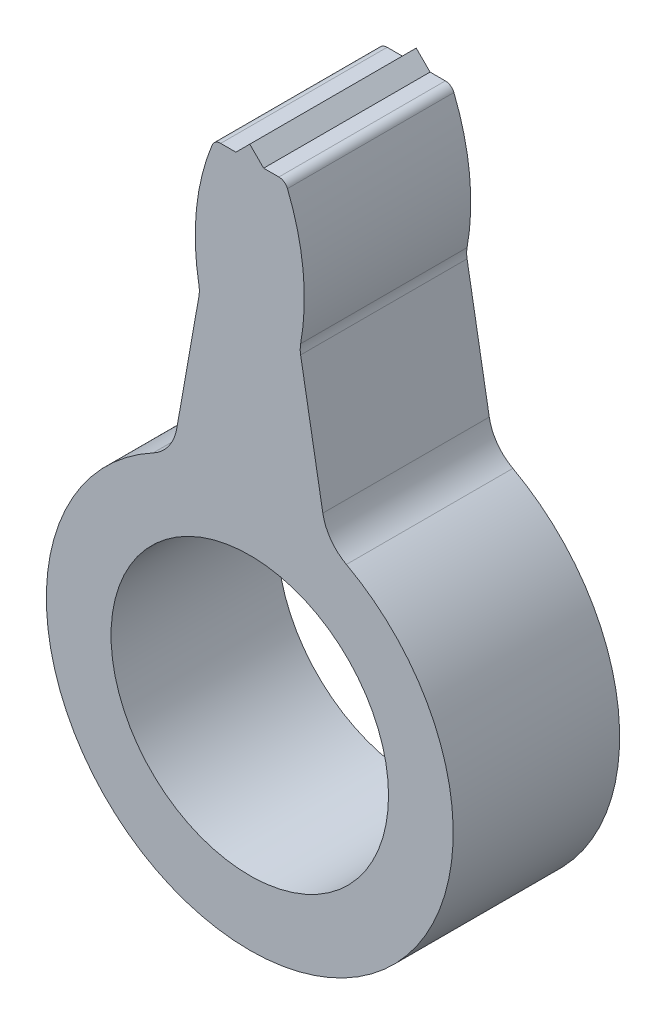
ISO-10303-21;
HEADER;
FILE_DESCRIPTION(('STEP AP214'),'2;1');
FILE_NAME('part.step','',(''),(''),'','','');
FILE_SCHEMA(('AUTOMOTIVE_DESIGN { 1 0 10303 214 1 1 1 1 }'));
ENDSEC;
DATA;
#1=APPLICATION_CONTEXT('core data for automotive mechanical design processes');
#2=APPLICATION_PROTOCOL_DEFINITION('international standard','automotive_design',2000,#1);
#3=PRODUCT_CONTEXT('',#1,'mechanical');
#4=PRODUCT('Part','Part','',(#3));
#5=PRODUCT_RELATED_PRODUCT_CATEGORY('part','',(#4));
#6=PRODUCT_DEFINITION_FORMATION('','',#4);
#7=PRODUCT_DEFINITION_CONTEXT('part definition',#1,'design');
#8=PRODUCT_DEFINITION('design','',#6,#7);
#9=PRODUCT_DEFINITION_SHAPE('','',#8);
#10=(LENGTH_UNIT() NAMED_UNIT(*) SI_UNIT(.MILLI.,.METRE.));
#11=(NAMED_UNIT(*) PLANE_ANGLE_UNIT() SI_UNIT($,.RADIAN.));
#12=(NAMED_UNIT(*) SI_UNIT($,.STERADIAN.) SOLID_ANGLE_UNIT());
#13=UNCERTAINTY_MEASURE_WITH_UNIT(LENGTH_MEASURE(1.E-05),#10,'distance_accuracy_value','');
#14=(GEOMETRIC_REPRESENTATION_CONTEXT(3) GLOBAL_UNCERTAINTY_ASSIGNED_CONTEXT((#13)) GLOBAL_UNIT_ASSIGNED_CONTEXT((#10,
#11,#12)) REPRESENTATION_CONTEXT('',''));
#15=CARTESIAN_POINT('',(0.,0.,0.));
#16=DIRECTION('',(0.,0.,1.));
#17=DIRECTION('',(1.,0.,0.));
#18=AXIS2_PLACEMENT_3D('',#15,#16,#17);
#19=CARTESIAN_POINT('',(-12.8234352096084,23.760461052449,18.));
#20=DIRECTION('',(0.,0.,-1.));
#21=DIRECTION('',(-1.,0.,0.));
#22=AXIS2_PLACEMENT_3D('',#19,#20,#21);
#23=PLANE('',#22);
#24=CARTESIAN_POINT('',(-12.8234352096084,23.760461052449,18.));
#25=DIRECTION('',(0.,0.,-1.));
#26=DIRECTION('',(-1.,0.,0.));
#27=AXIS2_PLACEMENT_3D('',#24,#25,#26);
#28=CIRCLE('',#27,4.99999999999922);
#29=CARTESIAN_POINT('',(-7.8993955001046,22.892225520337,18.));
#30=VERTEX_POINT('',#29);
#31=CARTESIAN_POINT('',(-10.448724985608,19.360375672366,18.));
#32=VERTEX_POINT('',#31);
#33=EDGE_CURVE('E199',#30,#32,#28,.T.);
#34=ORIENTED_EDGE('',*,*,#33,.T.);
#35=CARTESIAN_POINT('',(0.,1.2490009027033E-13,18.));
#36=DIRECTION('',(0.,0.,1.));
#37=DIRECTION('',(1.,0.,0.));
#38=AXIS2_PLACEMENT_3D('',#35,#36,#37);
#39=CIRCLE('',#38,22.0000000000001);
#40=CARTESIAN_POINT('',(10.448724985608,19.360375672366,18.));
#41=VERTEX_POINT('',#40);
#42=EDGE_CURVE('E112',#32,#41,#39,.T.);
#43=ORIENTED_EDGE('',*,*,#42,.T.);
#44=CARTESIAN_POINT('',(12.8234352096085,23.760461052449,18.));
#45=DIRECTION('',(0.,0.,-1.));
#46=DIRECTION('',(-1.,0.,0.));
#47=AXIS2_PLACEMENT_3D('',#44,#45,#46);
#48=CIRCLE('',#47,4.99999999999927);
#49=CARTESIAN_POINT('',(7.8993955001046,22.892225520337,18.));
#50=VERTEX_POINT('',#49);
#51=EDGE_CURVE('E235',#41,#50,#48,.T.);
#52=ORIENTED_EDGE('',*,*,#51,.T.);
#53=DIRECTION('',(-0.17364710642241,0.984807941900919,0.));
#54=VECTOR('',#53,1.);
#55=CARTESIAN_POINT('',(7.8993955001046,22.892225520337,18.));
#56=LINE('',#55,#54);
#57=CARTESIAN_POINT('',(5.4986047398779,36.507873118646,18.));
#58=VERTEX_POINT('',#57);
#59=EDGE_CURVE('E254',#50,#58,#56,.T.);
#60=ORIENTED_EDGE('',*,*,#59,.T.);
#61=CARTESIAN_POINT('',(8.45302856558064,37.0288144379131,18.));
#62=DIRECTION('',(0.,0.,-1.));
#63=DIRECTION('',(-1.,0.,0.));
#64=AXIS2_PLACEMENT_3D('',#61,#62,#63);
#65=CIRCLE('',#64,2.99999999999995);
#66=CARTESIAN_POINT('',(5.5007683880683,37.561880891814,18.));
#67=VERTEX_POINT('',#66);
#68=EDGE_CURVE('E251',#58,#67,#65,.T.);
#69=ORIENTED_EDGE('',*,*,#68,.T.);
#70=CARTESIAN_POINT('',(-19.1013999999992,42.0041000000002,18.));
#71=DIRECTION('',(0.,0.,1.));
#72=DIRECTION('',(1.,0.,0.));
#73=AXIS2_PLACEMENT_3D('',#70,#71,#72);
#74=CIRCLE('',#73,24.9999999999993);
#75=CARTESIAN_POINT('',(4.0759474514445,51.374829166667,18.));
#76=VERTEX_POINT('',#75);
#77=EDGE_CURVE('E253',#67,#76,#74,.T.);
#78=ORIENTED_EDGE('',*,*,#77,.T.);
#79=CARTESIAN_POINT('',(3.14885355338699,51.0000000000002,18.));
#80=DIRECTION('',(0.,0.,1.));
#81=DIRECTION('',(1.,0.,0.));
#82=AXIS2_PLACEMENT_3D('',#79,#80,#81);
#83=CIRCLE('',#82,0.999999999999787);
#84=CARTESIAN_POINT('',(3.1488535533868,52.,18.));
#85=VERTEX_POINT('',#84);
#86=EDGE_CURVE('E256',#76,#85,#83,.T.);
#87=ORIENTED_EDGE('',*,*,#86,.T.);
#88=DIRECTION('',(-1.,0.,0.));
#89=VECTOR('',#88,1.);
#90=CARTESIAN_POINT('',(3.1488535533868,52.,18.));
#91=LINE('',#90,#89);
#92=CARTESIAN_POINT('',(1.5,52.,18.));
#93=VERTEX_POINT('',#92);
#94=EDGE_CURVE('E262',#85,#93,#91,.T.);
#95=ORIENTED_EDGE('',*,*,#94,.T.);
#96=DIRECTION('',(-0.707106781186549,0.707106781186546,0.));
#97=VECTOR('',#96,1.);
#98=CARTESIAN_POINT('',(1.5,52.,18.));
#99=LINE('',#98,#97);
#100=CARTESIAN_POINT('',(0.,53.5,18.));
#101=VERTEX_POINT('',#100);
#102=EDGE_CURVE('E264',#93,#101,#99,.T.);
#103=ORIENTED_EDGE('',*,*,#102,.T.);
#104=DIRECTION('',(-0.707106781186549,-0.707106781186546,0.));
#105=VECTOR('',#104,1.);
#106=CARTESIAN_POINT('',(0.,53.5,18.));
#107=LINE('',#106,#105);
#108=CARTESIAN_POINT('',(-1.5,52.,18.));
#109=VERTEX_POINT('',#108);
#110=EDGE_CURVE('E266',#101,#109,#107,.T.);
#111=ORIENTED_EDGE('',*,*,#110,.T.);
#112=DIRECTION('',(-1.,0.,0.));
#113=VECTOR('',#112,1.);
#114=CARTESIAN_POINT('',(-1.5,52.,18.));
#115=LINE('',#114,#113);
#116=CARTESIAN_POINT('',(-3.1488535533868,52.,18.));
#117=VERTEX_POINT('',#116);
#118=EDGE_CURVE('E268',#109,#117,#115,.T.);
#119=ORIENTED_EDGE('',*,*,#118,.T.);
#120=CARTESIAN_POINT('',(-3.14885355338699,51.0000000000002,18.));
#121=DIRECTION('',(0.,0.,1.));
#122=DIRECTION('',(1.,0.,0.));
#123=AXIS2_PLACEMENT_3D('',#120,#121,#122);
#124=CIRCLE('',#123,0.999999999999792);
#125=CARTESIAN_POINT('',(-4.0759474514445,51.374829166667,18.));
#126=VERTEX_POINT('',#125);
#127=EDGE_CURVE('E152',#117,#126,#124,.T.);
#128=ORIENTED_EDGE('',*,*,#127,.T.);
#129=CARTESIAN_POINT('',(19.1014000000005,42.0040999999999,18.));
#130=DIRECTION('',(0.,0.,1.));
#131=DIRECTION('',(1.,0.,0.));
#132=AXIS2_PLACEMENT_3D('',#129,#130,#131);
#133=CIRCLE('',#132,25.0000000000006);
#134=CARTESIAN_POINT('',(-5.5007683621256,37.561880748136,18.));
#135=VERTEX_POINT('',#134);
#136=EDGE_CURVE('E146',#126,#135,#133,.T.);
#137=ORIENTED_EDGE('',*,*,#136,.T.);
#138=CARTESIAN_POINT('',(-8.45302856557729,37.0288144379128,18.));
#139=DIRECTION('',(0.,0.,-1.));
#140=DIRECTION('',(-1.,0.,0.));
#141=AXIS2_PLACEMENT_3D('',#138,#139,#140);
#142=CIRCLE('',#141,2.9999999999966);
#143=CARTESIAN_POINT('',(-5.4986047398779,36.507873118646,18.));
#144=VERTEX_POINT('',#143);
#145=EDGE_CURVE('E150',#135,#144,#142,.T.);
#146=ORIENTED_EDGE('',*,*,#145,.T.);
#147=DIRECTION('',(-0.17364710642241,-0.984807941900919,0.));
#148=VECTOR('',#147,1.);
#149=CARTESIAN_POINT('',(-5.4986047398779,36.507873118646,18.));
#150=LINE('',#149,#148);
#151=EDGE_CURVE('E48',#144,#30,#150,.T.);
#152=ORIENTED_EDGE('',*,*,#151,.T.);
#153=EDGE_LOOP('',(#34,#43,#52,#60,#69,#78,#87,#95,#103,#111,#119,#128,#137,#146,#152));
#154=FACE_BOUND('',#153,.T.);
#155=CARTESIAN_POINT('',(0.,1.2490009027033E-13,18.));
#156=DIRECTION('',(0.,0.,1.));
#157=DIRECTION('',(1.,0.,0.));
#158=AXIS2_PLACEMENT_3D('',#155,#156,#157);
#159=CIRCLE('',#158,15.005);
#160=CARTESIAN_POINT('',(15.005,1.2490009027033E-13,18.));
#161=VERTEX_POINT('',#160);
#162=EDGE_CURVE('E174',#161,#161,#159,.T.);
#163=ORIENTED_EDGE('',*,*,#162,.F.);
#164=EDGE_LOOP('',(#163));
#165=FACE_BOUND('',#164,.T.);
#166=ADVANCED_FACE('F31',(#154,#165),#23,.F.);
#167=CARTESIAN_POINT('',(-12.8234352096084,23.760461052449,0.));
#168=DIRECTION('',(0.,0.,-1.));
#169=DIRECTION('',(-1.,0.,0.));
#170=AXIS2_PLACEMENT_3D('',#167,#168,#169);
#171=PLANE('',#170);
#172=CARTESIAN_POINT('',(-12.8234352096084,23.760461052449,0.));
#173=DIRECTION('',(0.,0.,-1.));
#174=DIRECTION('',(-1.,0.,0.));
#175=AXIS2_PLACEMENT_3D('',#172,#173,#174);
#176=CIRCLE('',#175,4.99999999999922);
#177=CARTESIAN_POINT('',(-7.8993955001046,22.892225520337,0.));
#178=VERTEX_POINT('',#177);
#179=CARTESIAN_POINT('',(-10.448724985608,19.360375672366,0.));
#180=VERTEX_POINT('',#179);
#181=EDGE_CURVE('E170',#178,#180,#176,.T.);
#182=ORIENTED_EDGE('',*,*,#181,.F.);
#183=DIRECTION('',(-0.17364710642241,-0.984807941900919,0.));
#184=VECTOR('',#183,1.);
#185=CARTESIAN_POINT('',(-5.4986047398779,36.507873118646,0.));
#186=LINE('',#185,#184);
#187=CARTESIAN_POINT('',(-5.4986047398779,36.507873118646,0.));
#188=VERTEX_POINT('',#187);
#189=EDGE_CURVE('E104',#188,#178,#186,.T.);
#190=ORIENTED_EDGE('',*,*,#189,.F.);
#191=CARTESIAN_POINT('',(-8.45302856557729,37.0288144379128,0.));
#192=DIRECTION('',(0.,0.,-1.));
#193=DIRECTION('',(-1.,0.,0.));
#194=AXIS2_PLACEMENT_3D('',#191,#192,#193);
#195=CIRCLE('',#194,2.9999999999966);
#196=CARTESIAN_POINT('',(-5.5007683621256,37.561880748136,0.));
#197=VERTEX_POINT('',#196);
#198=EDGE_CURVE('E98',#197,#188,#195,.T.);
#199=ORIENTED_EDGE('',*,*,#198,.F.);
#200=CARTESIAN_POINT('',(19.1014000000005,42.0040999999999,0.));
#201=DIRECTION('',(0.,0.,1.));
#202=DIRECTION('',(1.,0.,0.));
#203=AXIS2_PLACEMENT_3D('',#200,#201,#202);
#204=CIRCLE('',#203,25.0000000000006);
#205=CARTESIAN_POINT('',(-4.0759474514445,51.374829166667,0.));
#206=VERTEX_POINT('',#205);
#207=EDGE_CURVE('E160',#206,#197,#204,.T.);
#208=ORIENTED_EDGE('',*,*,#207,.F.);
#209=CARTESIAN_POINT('',(-3.14885355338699,51.0000000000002,0.));
#210=DIRECTION('',(0.,0.,1.));
#211=DIRECTION('',(1.,0.,0.));
#212=AXIS2_PLACEMENT_3D('',#209,#210,#211);
#213=CIRCLE('',#212,0.999999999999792);
#214=CARTESIAN_POINT('',(-3.1488535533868,52.,0.));
#215=VERTEX_POINT('',#214);
#216=EDGE_CURVE('E194',#215,#206,#213,.T.);
#217=ORIENTED_EDGE('',*,*,#216,.F.);
#218=DIRECTION('',(-1.,0.,0.));
#219=VECTOR('',#218,1.);
#220=CARTESIAN_POINT('',(-1.5,52.,0.));
#221=LINE('',#220,#219);
#222=CARTESIAN_POINT('',(-1.5,52.,0.));
#223=VERTEX_POINT('',#222);
#224=EDGE_CURVE('E192',#223,#215,#221,.T.);
#225=ORIENTED_EDGE('',*,*,#224,.F.);
#226=DIRECTION('',(-0.707106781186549,-0.707106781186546,0.));
#227=VECTOR('',#226,1.);
#228=CARTESIAN_POINT('',(0.,53.5,0.));
#229=LINE('',#228,#227);
#230=CARTESIAN_POINT('',(0.,53.5,0.));
#231=VERTEX_POINT('',#230);
#232=EDGE_CURVE('E190',#231,#223,#229,.T.);
#233=ORIENTED_EDGE('',*,*,#232,.F.);
#234=DIRECTION('',(-0.707106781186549,0.707106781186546,0.));
#235=VECTOR('',#234,1.);
#236=CARTESIAN_POINT('',(1.5,52.,0.));
#237=LINE('',#236,#235);
#238=CARTESIAN_POINT('',(1.5,52.,0.));
#239=VERTEX_POINT('',#238);
#240=EDGE_CURVE('E188',#239,#231,#237,.T.);
#241=ORIENTED_EDGE('',*,*,#240,.F.);
#242=DIRECTION('',(-1.,0.,0.));
#243=VECTOR('',#242,1.);
#244=CARTESIAN_POINT('',(3.1488535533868,52.,0.));
#245=LINE('',#244,#243);
#246=CARTESIAN_POINT('',(3.1488535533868,52.,0.));
#247=VERTEX_POINT('',#246);
#248=EDGE_CURVE('E186',#247,#239,#245,.T.);
#249=ORIENTED_EDGE('',*,*,#248,.F.);
#250=CARTESIAN_POINT('',(3.14885355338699,51.0000000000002,0.));
#251=DIRECTION('',(0.,0.,1.));
#252=DIRECTION('',(1.,0.,0.));
#253=AXIS2_PLACEMENT_3D('',#250,#251,#252);
#254=CIRCLE('',#253,0.999999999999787);
#255=CARTESIAN_POINT('',(4.0759474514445,51.374829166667,0.));
#256=VERTEX_POINT('',#255);
#257=EDGE_CURVE('E184',#256,#247,#254,.T.);
#258=ORIENTED_EDGE('',*,*,#257,.F.);
#259=CARTESIAN_POINT('',(-19.1013999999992,42.0041000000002,0.));
#260=DIRECTION('',(0.,0.,1.));
#261=DIRECTION('',(1.,0.,0.));
#262=AXIS2_PLACEMENT_3D('',#259,#260,#261);
#263=CIRCLE('',#262,24.9999999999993);
#264=CARTESIAN_POINT('',(5.5007683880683,37.561880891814,0.));
#265=VERTEX_POINT('',#264);
#266=EDGE_CURVE('E182',#265,#256,#263,.T.);
#267=ORIENTED_EDGE('',*,*,#266,.F.);
#268=CARTESIAN_POINT('',(8.45302856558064,37.0288144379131,0.));
#269=DIRECTION('',(0.,0.,-1.));
#270=DIRECTION('',(-1.,0.,0.));
#271=AXIS2_PLACEMENT_3D('',#268,#269,#270);
#272=CIRCLE('',#271,2.99999999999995);
#273=CARTESIAN_POINT('',(5.4986047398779,36.507873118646,0.));
#274=VERTEX_POINT('',#273);
#275=EDGE_CURVE('E180',#274,#265,#272,.T.);
#276=ORIENTED_EDGE('',*,*,#275,.F.);
#277=DIRECTION('',(-0.17364710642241,0.984807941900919,0.));
#278=VECTOR('',#277,1.);
#279=CARTESIAN_POINT('',(7.8993955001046,22.892225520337,0.));
#280=LINE('',#279,#278);
#281=CARTESIAN_POINT('',(7.8993955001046,22.892225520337,0.));
#282=VERTEX_POINT('',#281);
#283=EDGE_CURVE('E178',#282,#274,#280,.T.);
#284=ORIENTED_EDGE('',*,*,#283,.F.);
#285=CARTESIAN_POINT('',(12.8234352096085,23.760461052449,0.));
#286=DIRECTION('',(0.,0.,-1.));
#287=DIRECTION('',(-1.,0.,0.));
#288=AXIS2_PLACEMENT_3D('',#285,#286,#287);
#289=CIRCLE('',#288,4.99999999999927);
#290=CARTESIAN_POINT('',(10.448724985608,19.360375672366,0.));
#291=VERTEX_POINT('',#290);
#292=EDGE_CURVE('E176',#291,#282,#289,.T.);
#293=ORIENTED_EDGE('',*,*,#292,.F.);
#294=CARTESIAN_POINT('',(0.,1.2490009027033E-13,0.));
#295=DIRECTION('',(0.,0.,1.));
#296=DIRECTION('',(1.,0.,0.));
#297=AXIS2_PLACEMENT_3D('',#294,#295,#296);
#298=CIRCLE('',#297,22.0000000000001);
#299=EDGE_CURVE('E173',#180,#291,#298,.T.);
#300=ORIENTED_EDGE('',*,*,#299,.F.);
#301=EDGE_LOOP('',(#182,#190,#199,#208,#217,#225,#233,#241,#249,#258,#267,#276,#284,#293,#300));
#302=FACE_BOUND('',#301,.T.);
#303=CARTESIAN_POINT('',(0.,1.2490009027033E-13,0.));
#304=DIRECTION('',(0.,0.,1.));
#305=DIRECTION('',(1.,0.,0.));
#306=AXIS2_PLACEMENT_3D('',#303,#304,#305);
#307=CIRCLE('',#306,15.005);
#308=CARTESIAN_POINT('',(15.005,1.2490009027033E-13,0.));
#309=VERTEX_POINT('',#308);
#310=EDGE_CURVE('E454',#309,#309,#307,.T.);
#311=ORIENTED_EDGE('',*,*,#310,.T.);
#312=EDGE_LOOP('',(#311));
#313=FACE_BOUND('',#312,.T.);
#314=ADVANCED_FACE('F239',(#302,#313),#171,.T.);
#315=CARTESIAN_POINT('',(-12.8234352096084,23.760461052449,18.));
#316=DIRECTION('',(0.,0.,-1.));
#317=DIRECTION('',(-1.,0.,0.));
#318=AXIS2_PLACEMENT_3D('',#315,#316,#317);
#319=CYLINDRICAL_SURFACE('',#318,4.99999999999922);
#320=ORIENTED_EDGE('',*,*,#181,.T.);
#321=DIRECTION('',(0.,0.,-1.));
#322=VECTOR('',#321,1.);
#323=CARTESIAN_POINT('',(-10.448724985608,19.360375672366,18.));
#324=LINE('',#323,#322);
#325=EDGE_CURVE('E11',#32,#180,#324,.T.);
#326=ORIENTED_EDGE('',*,*,#325,.F.);
#327=ORIENTED_EDGE('',*,*,#33,.F.);
#328=DIRECTION('',(0.,0.,-1.));
#329=VECTOR('',#328,1.);
#330=CARTESIAN_POINT('',(-7.8993955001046,22.892225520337,18.));
#331=LINE('',#330,#329);
#332=EDGE_CURVE('E166',#30,#178,#331,.T.);
#333=ORIENTED_EDGE('',*,*,#332,.T.);
#334=EDGE_LOOP('',(#320,#326,#327,#333));
#335=FACE_BOUND('',#334,.T.);
#336=ADVANCED_FACE('F33',(#335),#319,.F.);
#337=CARTESIAN_POINT('',(0.,1.2490009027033E-13,18.));
#338=DIRECTION('',(0.,0.,-1.));
#339=DIRECTION('',(-1.,0.,0.));
#340=AXIS2_PLACEMENT_3D('',#337,#338,#339);
#341=CYLINDRICAL_SURFACE('',#340,22.0000000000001);
#342=ORIENTED_EDGE('',*,*,#299,.T.);
#343=DIRECTION('',(0.,0.,-1.));
#344=VECTOR('',#343,1.);
#345=CARTESIAN_POINT('',(10.448724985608,19.360375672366,18.));
#346=LINE('',#345,#344);
#347=EDGE_CURVE('E40',#41,#291,#346,.T.);
#348=ORIENTED_EDGE('',*,*,#347,.F.);
#349=ORIENTED_EDGE('',*,*,#42,.F.);
#350=ORIENTED_EDGE('',*,*,#325,.T.);
#351=EDGE_LOOP('',(#342,#348,#349,#350));
#352=FACE_BOUND('',#351,.T.);
#353=ADVANCED_FACE('F302',(#352),#341,.T.);
#354=CARTESIAN_POINT('',(12.8234352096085,23.760461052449,18.));
#355=DIRECTION('',(0.,0.,-1.));
#356=DIRECTION('',(-1.,0.,0.));
#357=AXIS2_PLACEMENT_3D('',#354,#355,#356);
#358=CYLINDRICAL_SURFACE('',#357,4.99999999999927);
#359=ORIENTED_EDGE('',*,*,#292,.T.);
#360=DIRECTION('',(0.,0.,-1.));
#361=VECTOR('',#360,1.);
#362=CARTESIAN_POINT('',(7.8993955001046,22.892225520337,18.));
#363=LINE('',#362,#361);
#364=EDGE_CURVE('E227',#50,#282,#363,.T.);
#365=ORIENTED_EDGE('',*,*,#364,.F.);
#366=ORIENTED_EDGE('',*,*,#51,.F.);
#367=ORIENTED_EDGE('',*,*,#347,.T.);
#368=EDGE_LOOP('',(#359,#365,#366,#367));
#369=FACE_BOUND('',#368,.T.);
#370=ADVANCED_FACE('F233',(#369),#358,.F.);
#371=CARTESIAN_POINT('',(7.8993955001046,22.892225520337,18.));
#372=DIRECTION('',(-0.984807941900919,-0.17364710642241,0.));
#373=DIRECTION('',(0.17364710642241,-0.984807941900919,0.));
#374=AXIS2_PLACEMENT_3D('',#371,#372,#373);
#375=PLANE('',#374);
#376=ORIENTED_EDGE('',*,*,#283,.T.);
#377=DIRECTION('',(0.,0.,-1.));
#378=VECTOR('',#377,1.);
#379=CARTESIAN_POINT('',(5.4986047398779,36.507873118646,18.));
#380=LINE('',#379,#378);
#381=EDGE_CURVE('E224',#58,#274,#380,.T.);
#382=ORIENTED_EDGE('',*,*,#381,.F.);
#383=ORIENTED_EDGE('',*,*,#59,.F.);
#384=ORIENTED_EDGE('',*,*,#364,.T.);
#385=EDGE_LOOP('',(#376,#382,#383,#384));
#386=FACE_BOUND('',#385,.T.);
#387=ADVANCED_FACE('F245',(#386),#375,.F.);
#388=CARTESIAN_POINT('',(8.45302856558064,37.0288144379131,18.));
#389=DIRECTION('',(0.,0.,-1.));
#390=DIRECTION('',(-1.,0.,0.));
#391=AXIS2_PLACEMENT_3D('',#388,#389,#390);
#392=CYLINDRICAL_SURFACE('',#391,2.99999999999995);
#393=ORIENTED_EDGE('',*,*,#275,.T.);
#394=DIRECTION('',(0.,0.,-1.));
#395=VECTOR('',#394,1.);
#396=CARTESIAN_POINT('',(5.5007683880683,37.561880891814,18.));
#397=LINE('',#396,#395);
#398=EDGE_CURVE('E221',#67,#265,#397,.T.);
#399=ORIENTED_EDGE('',*,*,#398,.F.);
#400=ORIENTED_EDGE('',*,*,#68,.F.);
#401=ORIENTED_EDGE('',*,*,#381,.T.);
#402=EDGE_LOOP('',(#393,#399,#400,#401));
#403=FACE_BOUND('',#402,.T.);
#404=ADVANCED_FACE('F249',(#403),#392,.F.);
#405=CARTESIAN_POINT('',(-19.1013999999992,42.0041000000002,18.));
#406=DIRECTION('',(0.,0.,-1.));
#407=DIRECTION('',(-1.,0.,0.));
#408=AXIS2_PLACEMENT_3D('',#405,#406,#407);
#409=CYLINDRICAL_SURFACE('',#408,24.9999999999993);
#410=ORIENTED_EDGE('',*,*,#266,.T.);
#411=DIRECTION('',(0.,0.,-1.));
#412=VECTOR('',#411,1.);
#413=CARTESIAN_POINT('',(4.0759474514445,51.374829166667,18.));
#414=LINE('',#413,#412);
#415=EDGE_CURVE('E218',#76,#256,#414,.T.);
#416=ORIENTED_EDGE('',*,*,#415,.F.);
#417=ORIENTED_EDGE('',*,*,#77,.F.);
#418=ORIENTED_EDGE('',*,*,#398,.T.);
#419=EDGE_LOOP('',(#410,#416,#417,#418));
#420=FACE_BOUND('',#419,.T.);
#421=ADVANCED_FACE('F315',(#420),#409,.T.);
#422=CARTESIAN_POINT('',(3.14885355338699,51.0000000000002,18.));
#423=DIRECTION('',(0.,0.,-1.));
#424=DIRECTION('',(-1.,0.,0.));
#425=AXIS2_PLACEMENT_3D('',#422,#423,#424);
#426=CYLINDRICAL_SURFACE('',#425,0.999999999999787);
#427=ORIENTED_EDGE('',*,*,#257,.T.);
#428=DIRECTION('',(0.,0.,-1.));
#429=VECTOR('',#428,1.);
#430=CARTESIAN_POINT('',(3.1488535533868,52.,18.));
#431=LINE('',#430,#429);
#432=EDGE_CURVE('E215',#85,#247,#431,.T.);
#433=ORIENTED_EDGE('',*,*,#432,.F.);
#434=ORIENTED_EDGE('',*,*,#86,.F.);
#435=ORIENTED_EDGE('',*,*,#415,.T.);
#436=EDGE_LOOP('',(#427,#433,#434,#435));
#437=FACE_BOUND('',#436,.T.);
#438=ADVANCED_FACE('F318',(#437),#426,.T.);
#439=CARTESIAN_POINT('',(3.1488535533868,52.,18.));
#440=DIRECTION('',(0.,-1.,0.));
#441=DIRECTION('',(0.,0.,-1.));
#442=AXIS2_PLACEMENT_3D('',#439,#440,#441);
#443=PLANE('',#442);
#444=ORIENTED_EDGE('',*,*,#248,.T.);
#445=DIRECTION('',(0.,0.,-1.));
#446=VECTOR('',#445,1.);
#447=CARTESIAN_POINT('',(1.5,52.,18.));
#448=LINE('',#447,#446);
#449=EDGE_CURVE('E212',#93,#239,#448,.T.);
#450=ORIENTED_EDGE('',*,*,#449,.F.);
#451=ORIENTED_EDGE('',*,*,#94,.F.);
#452=ORIENTED_EDGE('',*,*,#432,.T.);
#453=EDGE_LOOP('',(#444,#450,#451,#452));
#454=FACE_BOUND('',#453,.T.);
#455=ADVANCED_FACE('F322',(#454),#443,.F.);
#456=CARTESIAN_POINT('',(1.5,52.,18.));
#457=DIRECTION('',(-0.707106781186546,-0.707106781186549,0.));
#458=DIRECTION('',(0.707106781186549,-0.707106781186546,0.));
#459=AXIS2_PLACEMENT_3D('',#456,#457,#458);
#460=PLANE('',#459);
#461=ORIENTED_EDGE('',*,*,#240,.T.);
#462=DIRECTION('',(0.,0.,-1.));
#463=VECTOR('',#462,1.);
#464=CARTESIAN_POINT('',(0.,53.5,18.));
#465=LINE('',#464,#463);
#466=EDGE_CURVE('E209',#101,#231,#465,.T.);
#467=ORIENTED_EDGE('',*,*,#466,.F.);
#468=ORIENTED_EDGE('',*,*,#102,.F.);
#469=ORIENTED_EDGE('',*,*,#449,.T.);
#470=EDGE_LOOP('',(#461,#467,#468,#469));
#471=FACE_BOUND('',#470,.T.);
#472=ADVANCED_FACE('F326',(#471),#460,.F.);
#473=CARTESIAN_POINT('',(0.,53.5,18.));
#474=DIRECTION('',(0.707106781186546,-0.707106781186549,0.));
#475=DIRECTION('',(0.707106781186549,0.707106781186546,0.));
#476=AXIS2_PLACEMENT_3D('',#473,#474,#475);
#477=PLANE('',#476);
#478=ORIENTED_EDGE('',*,*,#232,.T.);
#479=DIRECTION('',(0.,0.,-1.));
#480=VECTOR('',#479,1.);
#481=CARTESIAN_POINT('',(-1.5,52.,18.));
#482=LINE('',#481,#480);
#483=EDGE_CURVE('E206',#109,#223,#482,.T.);
#484=ORIENTED_EDGE('',*,*,#483,.F.);
#485=ORIENTED_EDGE('',*,*,#110,.F.);
#486=ORIENTED_EDGE('',*,*,#466,.T.);
#487=EDGE_LOOP('',(#478,#484,#485,#486));
#488=FACE_BOUND('',#487,.T.);
#489=ADVANCED_FACE('F330',(#488),#477,.F.);
#490=CARTESIAN_POINT('',(-1.5,52.,18.));
#491=DIRECTION('',(0.,-1.,0.));
#492=DIRECTION('',(0.,0.,-1.));
#493=AXIS2_PLACEMENT_3D('',#490,#491,#492);
#494=PLANE('',#493);
#495=ORIENTED_EDGE('',*,*,#224,.T.);
#496=DIRECTION('',(0.,0.,-1.));
#497=VECTOR('',#496,1.);
#498=CARTESIAN_POINT('',(-3.1488535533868,52.,18.));
#499=LINE('',#498,#497);
#500=EDGE_CURVE('E203',#117,#215,#499,.T.);
#501=ORIENTED_EDGE('',*,*,#500,.F.);
#502=ORIENTED_EDGE('',*,*,#118,.F.);
#503=ORIENTED_EDGE('',*,*,#483,.T.);
#504=EDGE_LOOP('',(#495,#501,#502,#503));
#505=FACE_BOUND('',#504,.T.);
#506=ADVANCED_FACE('F274',(#505),#494,.F.);
#507=CARTESIAN_POINT('',(-3.14885355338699,51.0000000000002,18.));
#508=DIRECTION('',(0.,0.,-1.));
#509=DIRECTION('',(-1.,0.,0.));
#510=AXIS2_PLACEMENT_3D('',#507,#508,#509);
#511=CYLINDRICAL_SURFACE('',#510,0.999999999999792);
#512=ORIENTED_EDGE('',*,*,#216,.T.);
#513=DIRECTION('',(0.,0.,-1.));
#514=VECTOR('',#513,1.);
#515=CARTESIAN_POINT('',(-4.0759474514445,51.374829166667,18.));
#516=LINE('',#515,#514);
#517=EDGE_CURVE('E161',#126,#206,#516,.T.);
#518=ORIENTED_EDGE('',*,*,#517,.F.);
#519=ORIENTED_EDGE('',*,*,#127,.F.);
#520=ORIENTED_EDGE('',*,*,#500,.T.);
#521=EDGE_LOOP('',(#512,#518,#519,#520));
#522=FACE_BOUND('',#521,.T.);
#523=ADVANCED_FACE('F278',(#522),#511,.T.);
#524=CARTESIAN_POINT('',(19.1014000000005,42.0040999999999,18.));
#525=DIRECTION('',(0.,0.,-1.));
#526=DIRECTION('',(-1.,0.,0.));
#527=AXIS2_PLACEMENT_3D('',#524,#525,#526);
#528=CYLINDRICAL_SURFACE('',#527,25.0000000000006);
#529=ORIENTED_EDGE('',*,*,#207,.T.);
#530=DIRECTION('',(0.,0.,-1.));
#531=VECTOR('',#530,1.);
#532=CARTESIAN_POINT('',(-5.5007683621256,37.561880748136,18.));
#533=LINE('',#532,#531);
#534=EDGE_CURVE('E157',#135,#197,#533,.T.);
#535=ORIENTED_EDGE('',*,*,#534,.F.);
#536=ORIENTED_EDGE('',*,*,#136,.F.);
#537=ORIENTED_EDGE('',*,*,#517,.T.);
#538=EDGE_LOOP('',(#529,#535,#536,#537));
#539=FACE_BOUND('',#538,.T.);
#540=ADVANCED_FACE('F158',(#539),#528,.T.);
#541=CARTESIAN_POINT('',(-8.45302856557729,37.0288144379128,18.));
#542=DIRECTION('',(0.,0.,-1.));
#543=DIRECTION('',(-1.,0.,0.));
#544=AXIS2_PLACEMENT_3D('',#541,#542,#543);
#545=CYLINDRICAL_SURFACE('',#544,2.9999999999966);
#546=ORIENTED_EDGE('',*,*,#198,.T.);
#547=DIRECTION('',(0.,0.,-1.));
#548=VECTOR('',#547,1.);
#549=CARTESIAN_POINT('',(-5.4986047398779,36.507873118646,18.));
#550=LINE('',#549,#548);
#551=EDGE_CURVE('E162',#144,#188,#550,.T.);
#552=ORIENTED_EDGE('',*,*,#551,.F.);
#553=ORIENTED_EDGE('',*,*,#145,.F.);
#554=ORIENTED_EDGE('',*,*,#534,.T.);
#555=EDGE_LOOP('',(#546,#552,#553,#554));
#556=FACE_BOUND('',#555,.T.);
#557=ADVANCED_FACE('F164',(#556),#545,.F.);
#558=CARTESIAN_POINT('',(-5.4986047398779,36.507873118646,18.));
#559=DIRECTION('',(0.984807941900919,-0.17364710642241,0.));
#560=DIRECTION('',(0.17364710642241,0.984807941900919,0.));
#561=AXIS2_PLACEMENT_3D('',#558,#559,#560);
#562=PLANE('',#561);
#563=ORIENTED_EDGE('',*,*,#189,.T.);
#564=ORIENTED_EDGE('',*,*,#332,.F.);
#565=ORIENTED_EDGE('',*,*,#151,.F.);
#566=ORIENTED_EDGE('',*,*,#551,.T.);
#567=EDGE_LOOP('',(#563,#564,#565,#566));
#568=FACE_BOUND('',#567,.T.);
#569=ADVANCED_FACE('F282',(#568),#562,.F.);
#570=CARTESIAN_POINT('',(0.,1.2490009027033E-13,18.));
#571=DIRECTION('',(0.,0.,-1.));
#572=DIRECTION('',(-1.,0.,0.));
#573=AXIS2_PLACEMENT_3D('',#570,#571,#572);
#574=CYLINDRICAL_SURFACE('',#573,15.005);
#575=ORIENTED_EDGE('',*,*,#162,.T.);
#576=EDGE_LOOP('',(#575));
#577=FACE_BOUND('',#576,.T.);
#578=ORIENTED_EDGE('',*,*,#310,.F.);
#579=EDGE_LOOP('',(#578));
#580=FACE_BOUND('',#579,.T.);
#581=ADVANCED_FACE('F284',(#577,#580),#574,.F.);
#582=CLOSED_SHELL('',(#166,#314,#336,#353,#370,#387,#404,#421,#438,#455,#472,#489,#506,#523,
#540,#557,#569,#581));
#583=MANIFOLD_SOLID_BREP('B2',#582);
#584=ADVANCED_BREP_SHAPE_REPRESENTATION('',(#18,#583),#14);
#585=SHAPE_DEFINITION_REPRESENTATION(#9,#584);
ENDSEC;
END-ISO-10303-21;
